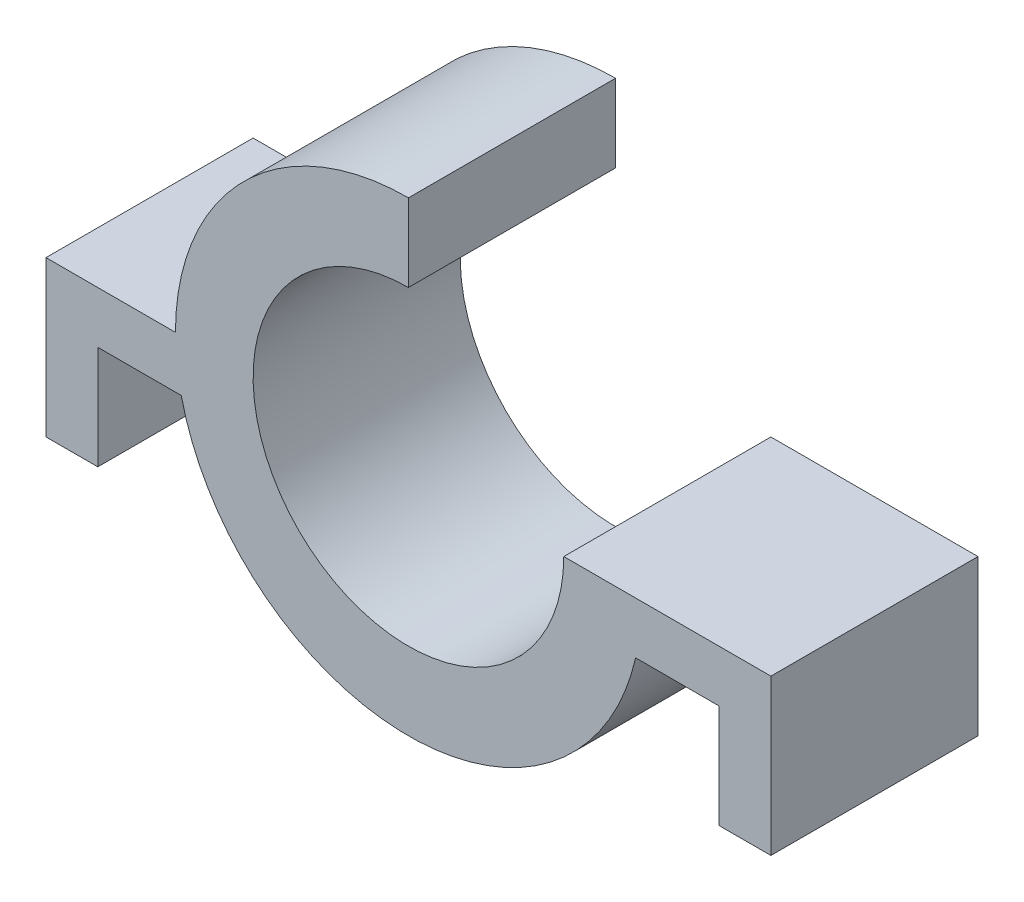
ISO-10303-21;
HEADER;
FILE_DESCRIPTION(('STEP AP214'),'2;1');
FILE_NAME('part.step','',(''),(''),'','','');
FILE_SCHEMA(('AUTOMOTIVE_DESIGN { 1 0 10303 214 1 1 1 1 }'));
ENDSEC;
DATA;
#1=APPLICATION_CONTEXT('core data for automotive mechanical design processes');
#2=APPLICATION_PROTOCOL_DEFINITION('international standard','automotive_design',2000,#1);
#3=PRODUCT_CONTEXT('',#1,'mechanical');
#4=PRODUCT('Part','Part','',(#3));
#5=PRODUCT_RELATED_PRODUCT_CATEGORY('part','',(#4));
#6=PRODUCT_DEFINITION_FORMATION('','',#4);
#7=PRODUCT_DEFINITION_CONTEXT('part definition',#1,'design');
#8=PRODUCT_DEFINITION('design','',#6,#7);
#9=PRODUCT_DEFINITION_SHAPE('','',#8);
#10=(LENGTH_UNIT() NAMED_UNIT(*) SI_UNIT(.MILLI.,.METRE.));
#11=(NAMED_UNIT(*) PLANE_ANGLE_UNIT() SI_UNIT($,.RADIAN.));
#12=(NAMED_UNIT(*) SI_UNIT($,.STERADIAN.) SOLID_ANGLE_UNIT());
#13=UNCERTAINTY_MEASURE_WITH_UNIT(LENGTH_MEASURE(1.E-05),#10,'distance_accuracy_value','');
#14=(GEOMETRIC_REPRESENTATION_CONTEXT(3) GLOBAL_UNCERTAINTY_ASSIGNED_CONTEXT((#13)) GLOBAL_UNIT_ASSIGNED_CONTEXT((#10,
#11,#12)) REPRESENTATION_CONTEXT('',''));
#15=CARTESIAN_POINT('',(0.,0.,0.));
#16=DIRECTION('',(0.,0.,1.));
#17=DIRECTION('',(1.,0.,0.));
#18=AXIS2_PLACEMENT_3D('',#15,#16,#17);
#19=CARTESIAN_POINT('',(0.,0.,4.));
#20=DIRECTION('',(0.,0.,-1.));
#21=DIRECTION('',(-1.,0.,0.));
#22=AXIS2_PLACEMENT_3D('',#19,#20,#21);
#23=CYLINDRICAL_SURFACE('',#22,4.5);
#24=DIRECTION('',(0.,0.,1.));
#25=VECTOR('',#24,1.);
#26=CARTESIAN_POINT('',(-4.38748219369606,-1.00000000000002,0.));
#27=LINE('',#26,#25);
#28=CARTESIAN_POINT('',(-4.38748219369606,-1.00000000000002,0.));
#29=VERTEX_POINT('',#28);
#30=CARTESIAN_POINT('',(-4.38748219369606,-1.00000000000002,4.));
#31=VERTEX_POINT('',#30);
#32=EDGE_CURVE('E180',#29,#31,#27,.T.);
#33=ORIENTED_EDGE('',*,*,#32,.F.);
#34=CARTESIAN_POINT('',(0.,0.,0.));
#35=DIRECTION('',(0.,0.,1.));
#36=DIRECTION('',(1.,0.,0.));
#37=AXIS2_PLACEMENT_3D('',#34,#35,#36);
#38=CIRCLE('',#37,4.5);
#39=CARTESIAN_POINT('',(4.38748219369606,-1.,0.));
#40=VERTEX_POINT('',#39);
#41=EDGE_CURVE('E58',#29,#40,#38,.T.);
#42=ORIENTED_EDGE('',*,*,#41,.T.);
#43=DIRECTION('',(0.,0.,1.));
#44=VECTOR('',#43,1.);
#45=CARTESIAN_POINT('',(4.38748219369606,-1.,0.));
#46=LINE('',#45,#44);
#47=CARTESIAN_POINT('',(4.38748219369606,-1.,4.));
#48=VERTEX_POINT('',#47);
#49=EDGE_CURVE('E219',#40,#48,#46,.T.);
#50=ORIENTED_EDGE('',*,*,#49,.T.);
#51=CARTESIAN_POINT('',(0.,0.,4.));
#52=DIRECTION('',(0.,0.,1.));
#53=DIRECTION('',(1.,0.,0.));
#54=AXIS2_PLACEMENT_3D('',#51,#52,#53);
#55=CIRCLE('',#54,4.5);
#56=EDGE_CURVE('E242',#31,#48,#55,.T.);
#57=ORIENTED_EDGE('',*,*,#56,.F.);
#58=EDGE_LOOP('',(#33,#42,#50,#57));
#59=FACE_BOUND('',#58,.T.);
#60=ADVANCED_FACE('F35',(#59),#23,.T.);
#61=CARTESIAN_POINT('',(0.,0.,4.));
#62=DIRECTION('',(0.,0.,1.));
#63=DIRECTION('',(1.,0.,0.));
#64=AXIS2_PLACEMENT_3D('',#61,#62,#63);
#65=PLANE('',#64);
#66=DIRECTION('',(0.,-1.,0.));
#67=VECTOR('',#66,1.);
#68=CARTESIAN_POINT('',(0.,0.,4.));
#69=LINE('',#68,#67);
#70=CARTESIAN_POINT('',(0.,4.5,4.));
#71=VERTEX_POINT('',#70);
#72=CARTESIAN_POINT('',(0.,3.,4.));
#73=VERTEX_POINT('',#72);
#74=EDGE_CURVE('E214',#71,#73,#69,.T.);
#75=ORIENTED_EDGE('',*,*,#74,.F.);
#76=CARTESIAN_POINT('',(-4.5,0.,4.));
#77=VERTEX_POINT('',#76);
#78=EDGE_CURVE('E239',#71,#77,#55,.T.);
#79=ORIENTED_EDGE('',*,*,#78,.T.);
#80=DIRECTION('',(-1.,0.,0.));
#81=VECTOR('',#80,1.);
#82=CARTESIAN_POINT('',(0.,0.,4.));
#83=LINE('',#82,#81);
#84=CARTESIAN_POINT('',(-7.,0.,4.));
#85=VERTEX_POINT('',#84);
#86=EDGE_CURVE('E170',#77,#85,#83,.T.);
#87=ORIENTED_EDGE('',*,*,#86,.T.);
#88=DIRECTION('',(0.,-1.,0.));
#89=VECTOR('',#88,1.);
#90=CARTESIAN_POINT('',(-7.,0.,4.));
#91=LINE('',#90,#89);
#92=CARTESIAN_POINT('',(-7.,-3.00000000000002,4.));
#93=VERTEX_POINT('',#92);
#94=EDGE_CURVE('E142',#85,#93,#91,.T.);
#95=ORIENTED_EDGE('',*,*,#94,.T.);
#96=DIRECTION('',(1.,0.,0.));
#97=VECTOR('',#96,1.);
#98=CARTESIAN_POINT('',(0.,-3.00000000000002,4.));
#99=LINE('',#98,#97);
#100=CARTESIAN_POINT('',(-6.,-3.00000000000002,4.));
#101=VERTEX_POINT('',#100);
#102=EDGE_CURVE('E173',#93,#101,#99,.T.);
#103=ORIENTED_EDGE('',*,*,#102,.T.);
#104=DIRECTION('',(0.,-1.,0.));
#105=VECTOR('',#104,1.);
#106=CARTESIAN_POINT('',(-6.,0.,4.));
#107=LINE('',#106,#105);
#108=CARTESIAN_POINT('',(-6.,-1.00000000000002,4.));
#109=VERTEX_POINT('',#108);
#110=EDGE_CURVE('E163',#109,#101,#107,.T.);
#111=ORIENTED_EDGE('',*,*,#110,.F.);
#112=DIRECTION('',(-1.,0.,0.));
#113=VECTOR('',#112,1.);
#114=CARTESIAN_POINT('',(0.,-1.00000000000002,4.));
#115=LINE('',#114,#113);
#116=EDGE_CURVE('E50',#31,#109,#115,.T.);
#117=ORIENTED_EDGE('',*,*,#116,.F.);
#118=ORIENTED_EDGE('',*,*,#56,.T.);
#119=DIRECTION('',(1.,0.,0.));
#120=VECTOR('',#119,1.);
#121=CARTESIAN_POINT('',(0.,-1.,4.));
#122=LINE('',#121,#120);
#123=CARTESIAN_POINT('',(6.,-1.,4.));
#124=VERTEX_POINT('',#123);
#125=EDGE_CURVE('E203',#48,#124,#122,.T.);
#126=ORIENTED_EDGE('',*,*,#125,.T.);
#127=DIRECTION('',(0.,-1.,0.));
#128=VECTOR('',#127,1.);
#129=CARTESIAN_POINT('',(6.,0.,4.));
#130=LINE('',#129,#128);
#131=CARTESIAN_POINT('',(6.,-3.,4.));
#132=VERTEX_POINT('',#131);
#133=EDGE_CURVE('E206',#124,#132,#130,.T.);
#134=ORIENTED_EDGE('',*,*,#133,.T.);
#135=DIRECTION('',(-1.,0.,0.));
#136=VECTOR('',#135,1.);
#137=CARTESIAN_POINT('',(0.,-3.,4.));
#138=LINE('',#137,#136);
#139=CARTESIAN_POINT('',(7.,-3.,4.));
#140=VERTEX_POINT('',#139);
#141=EDGE_CURVE('E192',#140,#132,#138,.T.);
#142=ORIENTED_EDGE('',*,*,#141,.F.);
#143=DIRECTION('',(0.,-1.,0.));
#144=VECTOR('',#143,1.);
#145=CARTESIAN_POINT('',(7.,0.,4.));
#146=LINE('',#145,#144);
#147=CARTESIAN_POINT('',(7.,0.,4.));
#148=VERTEX_POINT('',#147);
#149=EDGE_CURVE('E179',#148,#140,#146,.T.);
#150=ORIENTED_EDGE('',*,*,#149,.F.);
#151=DIRECTION('',(1.,0.,0.));
#152=VECTOR('',#151,1.);
#153=CARTESIAN_POINT('',(0.,0.,4.));
#154=LINE('',#153,#152);
#155=CARTESIAN_POINT('',(3.,0.,4.));
#156=VERTEX_POINT('',#155);
#157=EDGE_CURVE('E227',#156,#148,#154,.T.);
#158=ORIENTED_EDGE('',*,*,#157,.F.);
#159=CARTESIAN_POINT('',(0.,0.,4.));
#160=DIRECTION('',(0.,0.,1.));
#161=DIRECTION('',(1.,0.,0.));
#162=AXIS2_PLACEMENT_3D('',#159,#160,#161);
#163=CIRCLE('',#162,3.);
#164=EDGE_CURVE('E234',#73,#156,#163,.T.);
#165=ORIENTED_EDGE('',*,*,#164,.F.);
#166=EDGE_LOOP('',(#75,#79,#87,#95,#103,#111,#117,#118,#126,#134,#142,#150,#158,#165));
#167=FACE_BOUND('',#166,.T.);
#168=ADVANCED_FACE('F254',(#167),#65,.T.);
#169=CARTESIAN_POINT('',(0.,0.,0.));
#170=DIRECTION('',(0.,0.,1.));
#171=DIRECTION('',(1.,0.,0.));
#172=AXIS2_PLACEMENT_3D('',#169,#170,#171);
#173=PLANE('',#172);
#174=CARTESIAN_POINT('',(0.,4.5,0.));
#175=VERTEX_POINT('',#174);
#176=CARTESIAN_POINT('',(-4.5,0.,0.));
#177=VERTEX_POINT('',#176);
#178=EDGE_CURVE('E243',#175,#177,#38,.T.);
#179=ORIENTED_EDGE('',*,*,#178,.F.);
#180=DIRECTION('',(0.,-1.,0.));
#181=VECTOR('',#180,1.);
#182=CARTESIAN_POINT('',(0.,0.,0.));
#183=LINE('',#182,#181);
#184=CARTESIAN_POINT('',(0.,3.,0.));
#185=VERTEX_POINT('',#184);
#186=EDGE_CURVE('E223',#175,#185,#183,.T.);
#187=ORIENTED_EDGE('',*,*,#186,.T.);
#188=CARTESIAN_POINT('',(0.,0.,0.));
#189=DIRECTION('',(0.,0.,1.));
#190=DIRECTION('',(1.,0.,0.));
#191=AXIS2_PLACEMENT_3D('',#188,#189,#190);
#192=CIRCLE('',#191,3.);
#193=CARTESIAN_POINT('',(3.,0.,0.));
#194=VERTEX_POINT('',#193);
#195=EDGE_CURVE('E233',#185,#194,#192,.T.);
#196=ORIENTED_EDGE('',*,*,#195,.T.);
#197=DIRECTION('',(1.,0.,0.));
#198=VECTOR('',#197,1.);
#199=CARTESIAN_POINT('',(0.,0.,0.));
#200=LINE('',#199,#198);
#201=CARTESIAN_POINT('',(7.,0.,0.));
#202=VERTEX_POINT('',#201);
#203=EDGE_CURVE('E226',#194,#202,#200,.T.);
#204=ORIENTED_EDGE('',*,*,#203,.T.);
#205=DIRECTION('',(0.,-1.,0.));
#206=VECTOR('',#205,1.);
#207=CARTESIAN_POINT('',(7.,0.,0.));
#208=LINE('',#207,#206);
#209=CARTESIAN_POINT('',(7.,-3.,0.));
#210=VERTEX_POINT('',#209);
#211=EDGE_CURVE('E188',#202,#210,#208,.T.);
#212=ORIENTED_EDGE('',*,*,#211,.T.);
#213=DIRECTION('',(-1.,0.,0.));
#214=VECTOR('',#213,1.);
#215=CARTESIAN_POINT('',(0.,-3.,0.));
#216=LINE('',#215,#214);
#217=CARTESIAN_POINT('',(6.,-3.,0.));
#218=VERTEX_POINT('',#217);
#219=EDGE_CURVE('E198',#210,#218,#216,.T.);
#220=ORIENTED_EDGE('',*,*,#219,.T.);
#221=DIRECTION('',(0.,-1.,0.));
#222=VECTOR('',#221,1.);
#223=CARTESIAN_POINT('',(6.,0.,0.));
#224=LINE('',#223,#222);
#225=CARTESIAN_POINT('',(6.,-1.,0.));
#226=VERTEX_POINT('',#225);
#227=EDGE_CURVE('E195',#226,#218,#224,.T.);
#228=ORIENTED_EDGE('',*,*,#227,.F.);
#229=DIRECTION('',(1.,0.,0.));
#230=VECTOR('',#229,1.);
#231=CARTESIAN_POINT('',(0.,-1.,0.));
#232=LINE('',#231,#230);
#233=EDGE_CURVE('E191',#40,#226,#232,.T.);
#234=ORIENTED_EDGE('',*,*,#233,.F.);
#235=ORIENTED_EDGE('',*,*,#41,.F.);
#236=DIRECTION('',(-1.,0.,0.));
#237=VECTOR('',#236,1.);
#238=CARTESIAN_POINT('',(0.,-1.00000000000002,0.));
#239=LINE('',#238,#237);
#240=CARTESIAN_POINT('',(-6.,-1.00000000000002,0.));
#241=VERTEX_POINT('',#240);
#242=EDGE_CURVE('E147',#29,#241,#239,.T.);
#243=ORIENTED_EDGE('',*,*,#242,.T.);
#244=DIRECTION('',(0.,-1.,0.));
#245=VECTOR('',#244,1.);
#246=CARTESIAN_POINT('',(-6.,0.,0.));
#247=LINE('',#246,#245);
#248=CARTESIAN_POINT('',(-6.,-3.00000000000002,0.));
#249=VERTEX_POINT('',#248);
#250=EDGE_CURVE('E167',#241,#249,#247,.T.);
#251=ORIENTED_EDGE('',*,*,#250,.T.);
#252=DIRECTION('',(1.,0.,0.));
#253=VECTOR('',#252,1.);
#254=CARTESIAN_POINT('',(0.,-3.00000000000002,0.));
#255=LINE('',#254,#253);
#256=CARTESIAN_POINT('',(-7.,-3.00000000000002,0.));
#257=VERTEX_POINT('',#256);
#258=EDGE_CURVE('E157',#257,#249,#255,.T.);
#259=ORIENTED_EDGE('',*,*,#258,.F.);
#260=DIRECTION('',(0.,-1.,0.));
#261=VECTOR('',#260,1.);
#262=CARTESIAN_POINT('',(-7.,0.,0.));
#263=LINE('',#262,#261);
#264=CARTESIAN_POINT('',(-7.,0.,0.));
#265=VERTEX_POINT('',#264);
#266=EDGE_CURVE('E140',#265,#257,#263,.T.);
#267=ORIENTED_EDGE('',*,*,#266,.F.);
#268=DIRECTION('',(-1.,0.,0.));
#269=VECTOR('',#268,1.);
#270=CARTESIAN_POINT('',(0.,0.,0.));
#271=LINE('',#270,#269);
#272=EDGE_CURVE('E154',#177,#265,#271,.T.);
#273=ORIENTED_EDGE('',*,*,#272,.F.);
#274=EDGE_LOOP('',(#179,#187,#196,#204,#212,#220,#228,#234,#235,#243,#251,#259,#267,#273));
#275=FACE_BOUND('',#274,.T.);
#276=ADVANCED_FACE('F153',(#275),#173,.F.);
#277=ORIENTED_EDGE('',*,*,#178,.T.);
#278=DIRECTION('',(0.,0.,1.));
#279=VECTOR('',#278,1.);
#280=CARTESIAN_POINT('',(-4.5,0.,0.));
#281=LINE('',#280,#279);
#282=EDGE_CURVE('E161',#177,#77,#281,.T.);
#283=ORIENTED_EDGE('',*,*,#282,.T.);
#284=ORIENTED_EDGE('',*,*,#78,.F.);
#285=DIRECTION('',(0.,0.,1.));
#286=VECTOR('',#285,1.);
#287=CARTESIAN_POINT('',(0.,4.5,0.));
#288=LINE('',#287,#286);
#289=EDGE_CURVE('E229',#175,#71,#288,.T.);
#290=ORIENTED_EDGE('',*,*,#289,.F.);
#291=EDGE_LOOP('',(#277,#283,#284,#290));
#292=FACE_BOUND('',#291,.T.);
#293=ADVANCED_FACE('F37',(#292),#23,.T.);
#294=CARTESIAN_POINT('',(0.,0.,4.));
#295=DIRECTION('',(0.,0.,-1.));
#296=DIRECTION('',(-1.,0.,0.));
#297=AXIS2_PLACEMENT_3D('',#294,#295,#296);
#298=CYLINDRICAL_SURFACE('',#297,3.);
#299=DIRECTION('',(0.,0.,-1.));
#300=VECTOR('',#299,1.);
#301=CARTESIAN_POINT('',(0.,3.,4.));
#302=LINE('',#301,#300);
#303=EDGE_CURVE('E11',#73,#185,#302,.T.);
#304=ORIENTED_EDGE('',*,*,#303,.F.);
#305=ORIENTED_EDGE('',*,*,#164,.T.);
#306=DIRECTION('',(0.,0.,-1.));
#307=VECTOR('',#306,1.);
#308=CARTESIAN_POINT('',(3.,0.,4.));
#309=LINE('',#308,#307);
#310=EDGE_CURVE('E43',#194,#156,#309,.F.);
#311=ORIENTED_EDGE('',*,*,#310,.F.);
#312=ORIENTED_EDGE('',*,*,#195,.F.);
#313=EDGE_LOOP('',(#304,#305,#311,#312));
#314=FACE_BOUND('',#313,.T.);
#315=ADVANCED_FACE('F256',(#314),#298,.F.);
#316=CARTESIAN_POINT('',(0.,0.,0.));
#317=DIRECTION('',(0.,-1.,0.));
#318=DIRECTION('',(0.,0.,-1.));
#319=AXIS2_PLACEMENT_3D('',#316,#317,#318);
#320=PLANE('',#319);
#321=ORIENTED_EDGE('',*,*,#310,.T.);
#322=ORIENTED_EDGE('',*,*,#157,.T.);
#323=DIRECTION('',(0.,0.,1.));
#324=VECTOR('',#323,1.);
#325=CARTESIAN_POINT('',(7.,0.,0.));
#326=LINE('',#325,#324);
#327=EDGE_CURVE('E200',#202,#148,#326,.T.);
#328=ORIENTED_EDGE('',*,*,#327,.F.);
#329=ORIENTED_EDGE('',*,*,#203,.F.);
#330=EDGE_LOOP('',(#321,#322,#328,#329));
#331=FACE_BOUND('',#330,.T.);
#332=ADVANCED_FACE('F247',(#331),#320,.F.);
#333=CARTESIAN_POINT('',(0.,0.,0.));
#334=DIRECTION('',(-1.,0.,0.));
#335=DIRECTION('',(0.,0.,1.));
#336=AXIS2_PLACEMENT_3D('',#333,#334,#335);
#337=PLANE('',#336);
#338=ORIENTED_EDGE('',*,*,#303,.T.);
#339=ORIENTED_EDGE('',*,*,#186,.F.);
#340=ORIENTED_EDGE('',*,*,#289,.T.);
#341=ORIENTED_EDGE('',*,*,#74,.T.);
#342=EDGE_LOOP('',(#338,#339,#340,#341));
#343=FACE_BOUND('',#342,.T.);
#344=ADVANCED_FACE('F258',(#343),#337,.F.);
#345=CARTESIAN_POINT('',(7.,0.,0.));
#346=DIRECTION('',(-1.,0.,0.));
#347=DIRECTION('',(0.,0.,1.));
#348=AXIS2_PLACEMENT_3D('',#345,#346,#347);
#349=PLANE('',#348);
#350=ORIENTED_EDGE('',*,*,#149,.T.);
#351=DIRECTION('',(0.,0.,1.));
#352=VECTOR('',#351,1.);
#353=CARTESIAN_POINT('',(7.,-3.,0.));
#354=LINE('',#353,#352);
#355=EDGE_CURVE('E211',#210,#140,#354,.T.);
#356=ORIENTED_EDGE('',*,*,#355,.F.);
#357=ORIENTED_EDGE('',*,*,#211,.F.);
#358=ORIENTED_EDGE('',*,*,#327,.T.);
#359=EDGE_LOOP('',(#350,#356,#357,#358));
#360=FACE_BOUND('',#359,.T.);
#361=ADVANCED_FACE('F287',(#360),#349,.F.);
#362=CARTESIAN_POINT('',(0.,-3.,0.));
#363=DIRECTION('',(0.,1.,0.));
#364=DIRECTION('',(0.,0.,1.));
#365=AXIS2_PLACEMENT_3D('',#362,#363,#364);
#366=PLANE('',#365);
#367=ORIENTED_EDGE('',*,*,#141,.T.);
#368=DIRECTION('',(0.,0.,1.));
#369=VECTOR('',#368,1.);
#370=CARTESIAN_POINT('',(6.,-3.,0.));
#371=LINE('',#370,#369);
#372=EDGE_CURVE('E215',#218,#132,#371,.T.);
#373=ORIENTED_EDGE('',*,*,#372,.F.);
#374=ORIENTED_EDGE('',*,*,#219,.F.);
#375=ORIENTED_EDGE('',*,*,#355,.T.);
#376=EDGE_LOOP('',(#367,#373,#374,#375));
#377=FACE_BOUND('',#376,.T.);
#378=ADVANCED_FACE('F283',(#377),#366,.F.);
#379=CARTESIAN_POINT('',(6.,0.,0.));
#380=DIRECTION('',(-1.,0.,0.));
#381=DIRECTION('',(0.,0.,1.));
#382=AXIS2_PLACEMENT_3D('',#379,#380,#381);
#383=PLANE('',#382);
#384=ORIENTED_EDGE('',*,*,#133,.F.);
#385=DIRECTION('',(0.,0.,1.));
#386=VECTOR('',#385,1.);
#387=CARTESIAN_POINT('',(6.,-1.,0.));
#388=LINE('',#387,#386);
#389=EDGE_CURVE('E217',#226,#124,#388,.T.);
#390=ORIENTED_EDGE('',*,*,#389,.F.);
#391=ORIENTED_EDGE('',*,*,#227,.T.);
#392=ORIENTED_EDGE('',*,*,#372,.T.);
#393=EDGE_LOOP('',(#384,#390,#391,#392));
#394=FACE_BOUND('',#393,.T.);
#395=ADVANCED_FACE('F280',(#394),#383,.T.);
#396=CARTESIAN_POINT('',(0.,-1.,0.));
#397=DIRECTION('',(0.,-1.,0.));
#398=DIRECTION('',(0.,0.,-1.));
#399=AXIS2_PLACEMENT_3D('',#396,#397,#398);
#400=PLANE('',#399);
#401=ORIENTED_EDGE('',*,*,#125,.F.);
#402=ORIENTED_EDGE('',*,*,#49,.F.);
#403=ORIENTED_EDGE('',*,*,#233,.T.);
#404=ORIENTED_EDGE('',*,*,#389,.T.);
#405=EDGE_LOOP('',(#401,#402,#403,#404));
#406=FACE_BOUND('',#405,.T.);
#407=ADVANCED_FACE('F276',(#406),#400,.T.);
#408=CARTESIAN_POINT('',(0.,0.,0.));
#409=DIRECTION('',(0.,1.,0.));
#410=DIRECTION('',(0.,0.,1.));
#411=AXIS2_PLACEMENT_3D('',#408,#409,#410);
#412=PLANE('',#411);
#413=ORIENTED_EDGE('',*,*,#86,.F.);
#414=ORIENTED_EDGE('',*,*,#282,.F.);
#415=ORIENTED_EDGE('',*,*,#272,.T.);
#416=DIRECTION('',(0.,0.,1.));
#417=VECTOR('',#416,1.);
#418=CARTESIAN_POINT('',(-7.,0.,0.));
#419=LINE('',#418,#417);
#420=EDGE_CURVE('E137',#265,#85,#419,.T.);
#421=ORIENTED_EDGE('',*,*,#420,.T.);
#422=EDGE_LOOP('',(#413,#414,#415,#421));
#423=FACE_BOUND('',#422,.T.);
#424=ADVANCED_FACE('F159',(#423),#412,.T.);
#425=CARTESIAN_POINT('',(0.,-1.00000000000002,0.));
#426=DIRECTION('',(0.,1.,0.));
#427=DIRECTION('',(0.,0.,1.));
#428=AXIS2_PLACEMENT_3D('',#425,#426,#427);
#429=PLANE('',#428);
#430=ORIENTED_EDGE('',*,*,#116,.T.);
#431=DIRECTION('',(0.,0.,1.));
#432=VECTOR('',#431,1.);
#433=CARTESIAN_POINT('',(-6.,-1.00000000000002,0.));
#434=LINE('',#433,#432);
#435=EDGE_CURVE('E182',#241,#109,#434,.T.);
#436=ORIENTED_EDGE('',*,*,#435,.F.);
#437=ORIENTED_EDGE('',*,*,#242,.F.);
#438=ORIENTED_EDGE('',*,*,#32,.T.);
#439=EDGE_LOOP('',(#430,#436,#437,#438));
#440=FACE_BOUND('',#439,.T.);
#441=ADVANCED_FACE('F271',(#440),#429,.F.);
#442=CARTESIAN_POINT('',(-6.,0.,0.));
#443=DIRECTION('',(-1.,0.,0.));
#444=DIRECTION('',(0.,0.,1.));
#445=AXIS2_PLACEMENT_3D('',#442,#443,#444);
#446=PLANE('',#445);
#447=ORIENTED_EDGE('',*,*,#110,.T.);
#448=DIRECTION('',(0.,0.,1.));
#449=VECTOR('',#448,1.);
#450=CARTESIAN_POINT('',(-6.,-3.00000000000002,0.));
#451=LINE('',#450,#449);
#452=EDGE_CURVE('E185',#249,#101,#451,.T.);
#453=ORIENTED_EDGE('',*,*,#452,.F.);
#454=ORIENTED_EDGE('',*,*,#250,.F.);
#455=ORIENTED_EDGE('',*,*,#435,.T.);
#456=EDGE_LOOP('',(#447,#453,#454,#455));
#457=FACE_BOUND('',#456,.T.);
#458=ADVANCED_FACE('F268',(#457),#446,.F.);
#459=CARTESIAN_POINT('',(0.,-3.00000000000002,0.));
#460=DIRECTION('',(0.,-1.,0.));
#461=DIRECTION('',(0.,0.,-1.));
#462=AXIS2_PLACEMENT_3D('',#459,#460,#461);
#463=PLANE('',#462);
#464=ORIENTED_EDGE('',*,*,#102,.F.);
#465=DIRECTION('',(0.,0.,1.));
#466=VECTOR('',#465,1.);
#467=CARTESIAN_POINT('',(-7.,-3.00000000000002,0.));
#468=LINE('',#467,#466);
#469=EDGE_CURVE('E146',#257,#93,#468,.T.);
#470=ORIENTED_EDGE('',*,*,#469,.F.);
#471=ORIENTED_EDGE('',*,*,#258,.T.);
#472=ORIENTED_EDGE('',*,*,#452,.T.);
#473=EDGE_LOOP('',(#464,#470,#471,#472));
#474=FACE_BOUND('',#473,.T.);
#475=ADVANCED_FACE('F264',(#474),#463,.T.);
#476=CARTESIAN_POINT('',(-7.,0.,0.));
#477=DIRECTION('',(-1.,0.,0.));
#478=DIRECTION('',(0.,0.,1.));
#479=AXIS2_PLACEMENT_3D('',#476,#477,#478);
#480=PLANE('',#479);
#481=ORIENTED_EDGE('',*,*,#94,.F.);
#482=ORIENTED_EDGE('',*,*,#420,.F.);
#483=ORIENTED_EDGE('',*,*,#266,.T.);
#484=ORIENTED_EDGE('',*,*,#469,.T.);
#485=EDGE_LOOP('',(#481,#482,#483,#484));
#486=FACE_BOUND('',#485,.T.);
#487=ADVANCED_FACE('F139',(#486),#480,.T.);
#488=CLOSED_SHELL('',(#60,#168,#276,#293,#315,#332,#344,#361,#378,#395,#407,#424,#441,#458,#475,#487));
#489=MANIFOLD_SOLID_BREP('B2',#488);
#490=ADVANCED_BREP_SHAPE_REPRESENTATION('',(#18,#489),#14);
#491=SHAPE_DEFINITION_REPRESENTATION(#9,#490);
ENDSEC;
END-ISO-10303-21;
